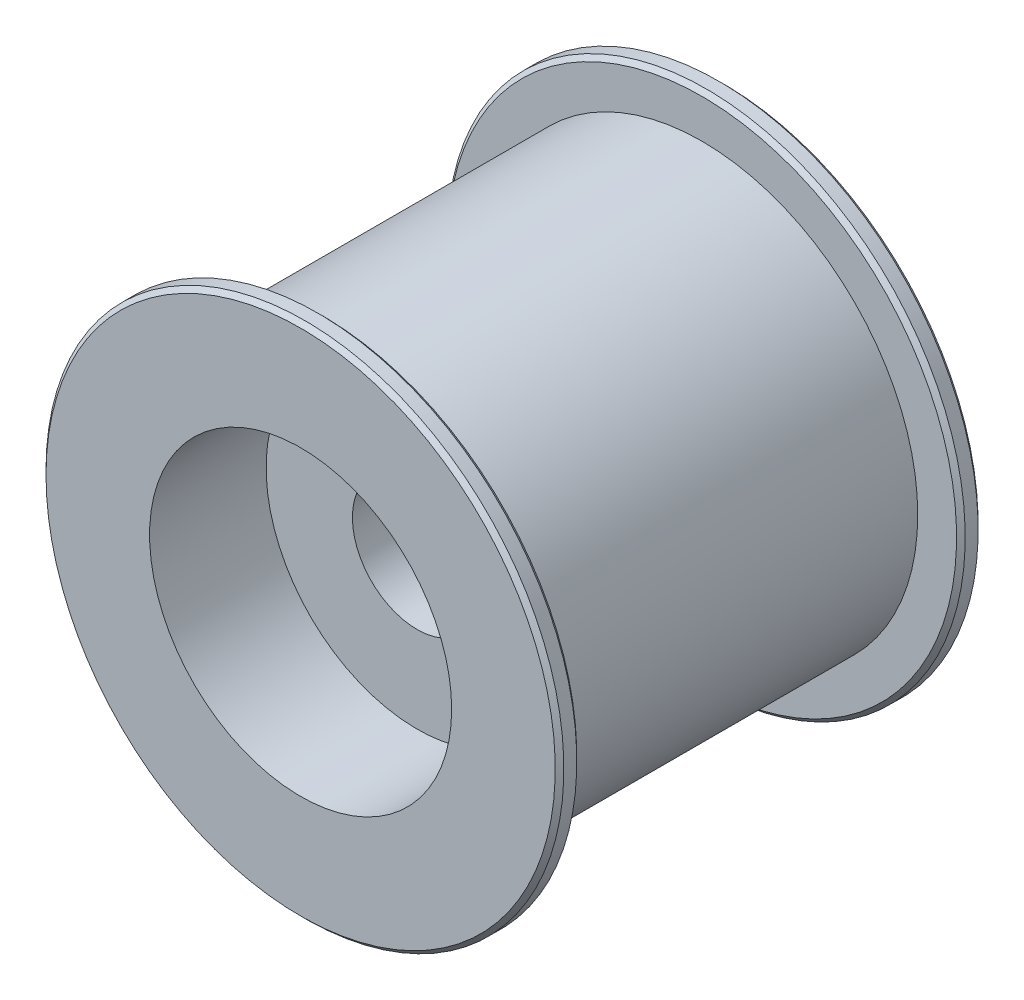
ISO-10303-21;
HEADER;
FILE_DESCRIPTION(('STEP AP214'),'2;1');
FILE_NAME('part.step','',(''),(''),'','','');
FILE_SCHEMA(('AUTOMOTIVE_DESIGN { 1 0 10303 214 1 1 1 1 }'));
ENDSEC;
DATA;
#1=APPLICATION_CONTEXT('core data for automotive mechanical design processes');
#2=APPLICATION_PROTOCOL_DEFINITION('international standard','automotive_design',2000,#1);
#3=PRODUCT_CONTEXT('',#1,'mechanical');
#4=PRODUCT('Part','Part','',(#3));
#5=PRODUCT_RELATED_PRODUCT_CATEGORY('part','',(#4));
#6=PRODUCT_DEFINITION_FORMATION('','',#4);
#7=PRODUCT_DEFINITION_CONTEXT('part definition',#1,'design');
#8=PRODUCT_DEFINITION('design','',#6,#7);
#9=PRODUCT_DEFINITION_SHAPE('','',#8);
#10=(LENGTH_UNIT() NAMED_UNIT(*) SI_UNIT(.MILLI.,.METRE.));
#11=(NAMED_UNIT(*) PLANE_ANGLE_UNIT() SI_UNIT($,.RADIAN.));
#12=(NAMED_UNIT(*) SI_UNIT($,.STERADIAN.) SOLID_ANGLE_UNIT());
#13=UNCERTAINTY_MEASURE_WITH_UNIT(LENGTH_MEASURE(1.E-05),#10,'distance_accuracy_value','');
#14=(GEOMETRIC_REPRESENTATION_CONTEXT(3) GLOBAL_UNCERTAINTY_ASSIGNED_CONTEXT((#13)) GLOBAL_UNIT_ASSIGNED_CONTEXT((#10,
#11,#12)) REPRESENTATION_CONTEXT('',''));
#15=CARTESIAN_POINT('',(0.,0.,0.));
#16=DIRECTION('',(0.,0.,1.));
#17=DIRECTION('',(1.,0.,0.));
#18=AXIS2_PLACEMENT_3D('',#15,#16,#17);
#19=CARTESIAN_POINT('',(0.,-14.999999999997,11.));
#20=DIRECTION('',(0.,0.,-1.));
#21=DIRECTION('',(1.,0.,0.));
#22=AXIS2_PLACEMENT_3D('',#19,#20,#21);
#23=PLANE('',#22);
#24=CARTESIAN_POINT('',(0.,0.,11.));
#25=DIRECTION('',(0.,0.,1.));
#26=DIRECTION('',(-1.,0.,0.));
#27=AXIS2_PLACEMENT_3D('',#24,#25,#26);
#28=CIRCLE('',#27,7.49999999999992);
#29=CARTESIAN_POINT('',(-7.49999999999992,0.,11.));
#30=VERTEX_POINT('',#29);
#31=EDGE_CURVE('E8',#30,#30,#28,.T.);
#32=ORIENTED_EDGE('',*,*,#31,.F.);
#33=EDGE_LOOP('',(#32));
#34=FACE_BOUND('',#33,.T.);
#35=CARTESIAN_POINT('',(0.,0.,11.));
#36=DIRECTION('',(0.,0.,1.));
#37=DIRECTION('',(1.,0.,0.));
#38=AXIS2_PLACEMENT_3D('',#35,#36,#37);
#39=CIRCLE('',#38,17.499999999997);
#40=CARTESIAN_POINT('',(17.499999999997,0.,11.));
#41=VERTEX_POINT('',#40);
#42=EDGE_CURVE('E58',#41,#41,#39,.T.);
#43=ORIENTED_EDGE('',*,*,#42,.T.);
#44=EDGE_LOOP('',(#43));
#45=FACE_BOUND('',#44,.T.);
#46=ADVANCED_FACE('F12',(#34,#45),#23,.F.);
#47=CARTESIAN_POINT('',(0.,0.,29.5));
#48=DIRECTION('',(0.,0.,1.));
#49=DIRECTION('',(-1.,0.,0.));
#50=AXIS2_PLACEMENT_3D('',#47,#48,#49);
#51=CYLINDRICAL_SURFACE('',#50,7.49999999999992);
#52=CARTESIAN_POINT('',(0.,0.,-11.0000000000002));
#53=DIRECTION('',(0.,0.,1.));
#54=DIRECTION('',(-1.,0.,0.));
#55=AXIS2_PLACEMENT_3D('',#52,#53,#54);
#56=CIRCLE('',#55,7.49999999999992);
#57=CARTESIAN_POINT('',(-7.49999999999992,0.,-11.0000000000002));
#58=VERTEX_POINT('',#57);
#59=EDGE_CURVE('E18',#58,#58,#56,.T.);
#60=ORIENTED_EDGE('',*,*,#59,.F.);
#61=EDGE_LOOP('',(#60));
#62=FACE_BOUND('',#61,.T.);
#63=ORIENTED_EDGE('',*,*,#31,.T.);
#64=EDGE_LOOP('',(#63));
#65=FACE_BOUND('',#64,.T.);
#66=ADVANCED_FACE('F84',(#62,#65),#51,.F.);
#67=CARTESIAN_POINT('',(0.,-14.,-11.0000000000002));
#68=DIRECTION('',(0.,0.,1.));
#69=DIRECTION('',(-1.,0.,0.));
#70=AXIS2_PLACEMENT_3D('',#67,#68,#69);
#71=PLANE('',#70);
#72=CARTESIAN_POINT('',(0.,0.,-11.0000000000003));
#73=DIRECTION('',(0.,0.,1.));
#74=DIRECTION('',(-1.,0.,0.));
#75=AXIS2_PLACEMENT_3D('',#72,#73,#74);
#76=CIRCLE('',#75,14.);
#77=CARTESIAN_POINT('',(-14.,0.,-11.0000000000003));
#78=VERTEX_POINT('',#77);
#79=EDGE_CURVE('E22',#78,#78,#76,.T.);
#80=ORIENTED_EDGE('',*,*,#79,.F.);
#81=EDGE_LOOP('',(#80));
#82=FACE_BOUND('',#81,.T.);
#83=ORIENTED_EDGE('',*,*,#59,.T.);
#84=EDGE_LOOP('',(#83));
#85=FACE_BOUND('',#84,.T.);
#86=ADVANCED_FACE('F72',(#82,#85),#71,.F.);
#87=CARTESIAN_POINT('',(0.,0.,29.5));
#88=DIRECTION('',(0.,0.,1.));
#89=DIRECTION('',(-1.,0.,0.));
#90=AXIS2_PLACEMENT_3D('',#87,#88,#89);
#91=CYLINDRICAL_SURFACE('',#90,14.);
#92=ORIENTED_EDGE('',*,*,#79,.T.);
#93=EDGE_LOOP('',(#92));
#94=FACE_BOUND('',#93,.T.);
#95=CARTESIAN_POINT('',(0.,0.,-24.5));
#96=DIRECTION('',(0.,0.,1.));
#97=DIRECTION('',(1.,0.,0.));
#98=AXIS2_PLACEMENT_3D('',#95,#96,#97);
#99=CIRCLE('',#98,14.);
#100=CARTESIAN_POINT('',(14.,0.,-24.5));
#101=VERTEX_POINT('',#100);
#102=EDGE_CURVE('E64',#101,#101,#99,.T.);
#103=ORIENTED_EDGE('',*,*,#102,.F.);
#104=EDGE_LOOP('',(#103));
#105=FACE_BOUND('',#104,.T.);
#106=ADVANCED_FACE('F70',(#94,#105),#91,.F.);
#107=CARTESIAN_POINT('',(0.,-29.5,-24.5));
#108=DIRECTION('',(0.,0.,1.));
#109=DIRECTION('',(-1.,0.,0.));
#110=AXIS2_PLACEMENT_3D('',#107,#108,#109);
#111=PLANE('',#110);
#112=CARTESIAN_POINT('',(0.,0.,-24.5));
#113=DIRECTION('',(0.,0.,1.));
#114=DIRECTION('',(-1.,0.,0.));
#115=AXIS2_PLACEMENT_3D('',#112,#113,#114);
#116=CIRCLE('',#115,29.5);
#117=CARTESIAN_POINT('',(-29.5,0.,-24.5));
#118=VERTEX_POINT('',#117);
#119=EDGE_CURVE('E26',#118,#118,#116,.T.);
#120=ORIENTED_EDGE('',*,*,#119,.F.);
#121=EDGE_LOOP('',(#120));
#122=FACE_BOUND('',#121,.T.);
#123=ORIENTED_EDGE('',*,*,#102,.T.);
#124=EDGE_LOOP('',(#123));
#125=FACE_BOUND('',#124,.T.);
#126=ADVANCED_FACE('F68',(#122,#125),#111,.F.);
#127=CARTESIAN_POINT('',(0.,0.,-24.5));
#128=DIRECTION('',(0.,0.,1.));
#129=DIRECTION('',(-1.,0.,0.));
#130=AXIS2_PLACEMENT_3D('',#127,#128,#129);
#131=CONICAL_SURFACE('',#130,29.5,0.785398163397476);
#132=CARTESIAN_POINT('',(0.,0.,-24.));
#133=DIRECTION('',(0.,0.,1.));
#134=DIRECTION('',(-1.,0.,0.));
#135=AXIS2_PLACEMENT_3D('',#132,#133,#134);
#136=CIRCLE('',#135,30.);
#137=CARTESIAN_POINT('',(-30.,0.,-24.));
#138=VERTEX_POINT('',#137);
#139=EDGE_CURVE('E31',#138,#138,#136,.T.);
#140=ORIENTED_EDGE('',*,*,#139,.F.);
#141=EDGE_LOOP('',(#140));
#142=FACE_BOUND('',#141,.T.);
#143=ORIENTED_EDGE('',*,*,#119,.T.);
#144=EDGE_LOOP('',(#143));
#145=FACE_BOUND('',#144,.T.);
#146=ADVANCED_FACE('F81',(#142,#145),#131,.T.);
#147=CARTESIAN_POINT('',(0.,0.,29.5));
#148=DIRECTION('',(0.,0.,1.));
#149=DIRECTION('',(-1.,0.,0.));
#150=AXIS2_PLACEMENT_3D('',#147,#148,#149);
#151=CYLINDRICAL_SURFACE('',#150,30.);
#152=CARTESIAN_POINT('',(0.,0.,-22.5));
#153=DIRECTION('',(0.,0.,1.));
#154=DIRECTION('',(-1.,0.,0.));
#155=AXIS2_PLACEMENT_3D('',#152,#153,#154);
#156=CIRCLE('',#155,30.);
#157=CARTESIAN_POINT('',(-30.,0.,-22.5));
#158=VERTEX_POINT('',#157);
#159=EDGE_CURVE('E34',#158,#158,#156,.T.);
#160=ORIENTED_EDGE('',*,*,#159,.F.);
#161=EDGE_LOOP('',(#160));
#162=FACE_BOUND('',#161,.T.);
#163=ORIENTED_EDGE('',*,*,#139,.T.);
#164=EDGE_LOOP('',(#163));
#165=FACE_BOUND('',#164,.T.);
#166=ADVANCED_FACE('F138',(#162,#165),#151,.T.);
#167=CARTESIAN_POINT('',(0.,0.,-22.5));
#168=DIRECTION('',(0.,0.,-1.));
#169=DIRECTION('',(1.,0.,0.));
#170=AXIS2_PLACEMENT_3D('',#167,#168,#169);
#171=CONICAL_SURFACE('',#170,30.,0.785398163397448);
#172=CARTESIAN_POINT('',(0.,0.,-22.));
#173=DIRECTION('',(0.,0.,1.));
#174=DIRECTION('',(-1.,0.,0.));
#175=AXIS2_PLACEMENT_3D('',#172,#173,#174);
#176=CIRCLE('',#175,29.5);
#177=CARTESIAN_POINT('',(-29.5,0.,-22.));
#178=VERTEX_POINT('',#177);
#179=EDGE_CURVE('E37',#178,#178,#176,.T.);
#180=ORIENTED_EDGE('',*,*,#179,.F.);
#181=EDGE_LOOP('',(#180));
#182=FACE_BOUND('',#181,.T.);
#183=ORIENTED_EDGE('',*,*,#159,.T.);
#184=EDGE_LOOP('',(#183));
#185=FACE_BOUND('',#184,.T.);
#186=ADVANCED_FACE('F134',(#182,#185),#171,.T.);
#187=CARTESIAN_POINT('',(0.,-29.5,-22.));
#188=DIRECTION('',(0.,0.,-1.));
#189=DIRECTION('',(1.,0.,0.));
#190=AXIS2_PLACEMENT_3D('',#187,#188,#189);
#191=PLANE('',#190);
#192=CARTESIAN_POINT('',(0.,0.,-22.));
#193=DIRECTION('',(0.,0.,1.));
#194=DIRECTION('',(-1.,0.,0.));
#195=AXIS2_PLACEMENT_3D('',#192,#193,#194);
#196=CIRCLE('',#195,25.);
#197=CARTESIAN_POINT('',(-25.,0.,-22.));
#198=VERTEX_POINT('',#197);
#199=EDGE_CURVE('E40',#198,#198,#196,.T.);
#200=ORIENTED_EDGE('',*,*,#199,.F.);
#201=EDGE_LOOP('',(#200));
#202=FACE_BOUND('',#201,.T.);
#203=ORIENTED_EDGE('',*,*,#179,.T.);
#204=EDGE_LOOP('',(#203));
#205=FACE_BOUND('',#204,.T.);
#206=ADVANCED_FACE('F130',(#202,#205),#191,.F.);
#207=CARTESIAN_POINT('',(0.,0.,29.5));
#208=DIRECTION('',(0.,0.,1.));
#209=DIRECTION('',(-1.,0.,0.));
#210=AXIS2_PLACEMENT_3D('',#207,#208,#209);
#211=CYLINDRICAL_SURFACE('',#210,25.);
#212=CARTESIAN_POINT('',(0.,0.,22.));
#213=DIRECTION('',(0.,0.,1.));
#214=DIRECTION('',(-1.,0.,0.));
#215=AXIS2_PLACEMENT_3D('',#212,#213,#214);
#216=CIRCLE('',#215,25.);
#217=CARTESIAN_POINT('',(-25.,0.,22.));
#218=VERTEX_POINT('',#217);
#219=EDGE_CURVE('E43',#218,#218,#216,.T.);
#220=ORIENTED_EDGE('',*,*,#219,.F.);
#221=EDGE_LOOP('',(#220));
#222=FACE_BOUND('',#221,.T.);
#223=ORIENTED_EDGE('',*,*,#199,.T.);
#224=EDGE_LOOP('',(#223));
#225=FACE_BOUND('',#224,.T.);
#226=ADVANCED_FACE('F126',(#222,#225),#211,.T.);
#227=CARTESIAN_POINT('',(0.,-29.5,22.));
#228=DIRECTION('',(0.,0.,1.));
#229=DIRECTION('',(-1.,0.,0.));
#230=AXIS2_PLACEMENT_3D('',#227,#228,#229);
#231=PLANE('',#230);
#232=CARTESIAN_POINT('',(0.,0.,22.));
#233=DIRECTION('',(0.,0.,1.));
#234=DIRECTION('',(-1.,0.,0.));
#235=AXIS2_PLACEMENT_3D('',#232,#233,#234);
#236=CIRCLE('',#235,29.5);
#237=CARTESIAN_POINT('',(-29.5,0.,22.));
#238=VERTEX_POINT('',#237);
#239=EDGE_CURVE('E46',#238,#238,#236,.T.);
#240=ORIENTED_EDGE('',*,*,#239,.F.);
#241=EDGE_LOOP('',(#240));
#242=FACE_BOUND('',#241,.T.);
#243=ORIENTED_EDGE('',*,*,#219,.T.);
#244=EDGE_LOOP('',(#243));
#245=FACE_BOUND('',#244,.T.);
#246=ADVANCED_FACE('F122',(#242,#245),#231,.F.);
#247=CARTESIAN_POINT('',(0.,0.,22.));
#248=DIRECTION('',(0.,0.,1.));
#249=DIRECTION('',(-1.,0.,0.));
#250=AXIS2_PLACEMENT_3D('',#247,#248,#249);
#251=CONICAL_SURFACE('',#250,29.5,0.785398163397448);
#252=CARTESIAN_POINT('',(0.,0.,22.5));
#253=DIRECTION('',(0.,0.,1.));
#254=DIRECTION('',(-1.,0.,0.));
#255=AXIS2_PLACEMENT_3D('',#252,#253,#254);
#256=CIRCLE('',#255,30.);
#257=CARTESIAN_POINT('',(-30.,0.,22.5));
#258=VERTEX_POINT('',#257);
#259=EDGE_CURVE('E49',#258,#258,#256,.T.);
#260=ORIENTED_EDGE('',*,*,#259,.F.);
#261=EDGE_LOOP('',(#260));
#262=FACE_BOUND('',#261,.T.);
#263=ORIENTED_EDGE('',*,*,#239,.T.);
#264=EDGE_LOOP('',(#263));
#265=FACE_BOUND('',#264,.T.);
#266=ADVANCED_FACE('F118',(#262,#265),#251,.T.);
#267=CARTESIAN_POINT('',(0.,0.,29.5));
#268=DIRECTION('',(0.,0.,1.));
#269=DIRECTION('',(-1.,0.,0.));
#270=AXIS2_PLACEMENT_3D('',#267,#268,#269);
#271=CYLINDRICAL_SURFACE('',#270,30.);
#272=CARTESIAN_POINT('',(0.,0.,24.));
#273=DIRECTION('',(0.,0.,1.));
#274=DIRECTION('',(-1.,0.,0.));
#275=AXIS2_PLACEMENT_3D('',#272,#273,#274);
#276=CIRCLE('',#275,30.);
#277=CARTESIAN_POINT('',(-30.,0.,24.));
#278=VERTEX_POINT('',#277);
#279=EDGE_CURVE('E52',#278,#278,#276,.T.);
#280=ORIENTED_EDGE('',*,*,#279,.F.);
#281=EDGE_LOOP('',(#280));
#282=FACE_BOUND('',#281,.T.);
#283=ORIENTED_EDGE('',*,*,#259,.T.);
#284=EDGE_LOOP('',(#283));
#285=FACE_BOUND('',#284,.T.);
#286=ADVANCED_FACE('F112',(#282,#285),#271,.T.);
#287=CARTESIAN_POINT('',(0.,0.,24.));
#288=DIRECTION('',(0.,0.,-1.));
#289=DIRECTION('',(1.,0.,0.));
#290=AXIS2_PLACEMENT_3D('',#287,#288,#289);
#291=CONICAL_SURFACE('',#290,30.,0.785398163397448);
#292=CARTESIAN_POINT('',(0.,0.,24.5));
#293=DIRECTION('',(0.,0.,1.));
#294=DIRECTION('',(-1.,0.,0.));
#295=AXIS2_PLACEMENT_3D('',#292,#293,#294);
#296=CIRCLE('',#295,29.5);
#297=CARTESIAN_POINT('',(-29.5,0.,24.5));
#298=VERTEX_POINT('',#297);
#299=EDGE_CURVE('E55',#298,#298,#296,.T.);
#300=ORIENTED_EDGE('',*,*,#299,.F.);
#301=EDGE_LOOP('',(#300));
#302=FACE_BOUND('',#301,.T.);
#303=ORIENTED_EDGE('',*,*,#279,.T.);
#304=EDGE_LOOP('',(#303));
#305=FACE_BOUND('',#304,.T.);
#306=ADVANCED_FACE('F105',(#302,#305),#291,.T.);
#307=CARTESIAN_POINT('',(0.,-29.5,24.5));
#308=DIRECTION('',(0.,0.,-1.));
#309=DIRECTION('',(1.,0.,0.));
#310=AXIS2_PLACEMENT_3D('',#307,#308,#309);
#311=PLANE('',#310);
#312=ORIENTED_EDGE('',*,*,#299,.T.);
#313=EDGE_LOOP('',(#312));
#314=FACE_BOUND('',#313,.T.);
#315=CARTESIAN_POINT('',(0.,0.,24.5));
#316=DIRECTION('',(0.,0.,1.));
#317=DIRECTION('',(1.,0.,0.));
#318=AXIS2_PLACEMENT_3D('',#315,#316,#317);
#319=CIRCLE('',#318,17.499999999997);
#320=CARTESIAN_POINT('',(17.499999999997,0.,24.5));
#321=VERTEX_POINT('',#320);
#322=EDGE_CURVE('E61',#321,#321,#319,.T.);
#323=ORIENTED_EDGE('',*,*,#322,.F.);
#324=EDGE_LOOP('',(#323));
#325=FACE_BOUND('',#324,.T.);
#326=ADVANCED_FACE('F100',(#314,#325),#311,.F.);
#327=CARTESIAN_POINT('',(0.,0.,29.5));
#328=DIRECTION('',(0.,0.,1.));
#329=DIRECTION('',(-1.,0.,0.));
#330=AXIS2_PLACEMENT_3D('',#327,#328,#329);
#331=CYLINDRICAL_SURFACE('',#330,17.499999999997);
#332=ORIENTED_EDGE('',*,*,#42,.F.);
#333=EDGE_LOOP('',(#332));
#334=FACE_BOUND('',#333,.T.);
#335=ORIENTED_EDGE('',*,*,#322,.T.);
#336=EDGE_LOOP('',(#335));
#337=FACE_BOUND('',#336,.T.);
#338=ADVANCED_FACE('F97',(#334,#337),#331,.F.);
#339=CLOSED_SHELL('',(#46,#66,#86,#106,#126,#146,#166,#186,#206,#226,#246,#266,#286,#306,#326,#338));
#340=MANIFOLD_SOLID_BREP('B1',#339);
#341=ADVANCED_BREP_SHAPE_REPRESENTATION('',(#18,#340),#14);
#342=SHAPE_DEFINITION_REPRESENTATION(#9,#341);
ENDSEC;
END-ISO-10303-21;
